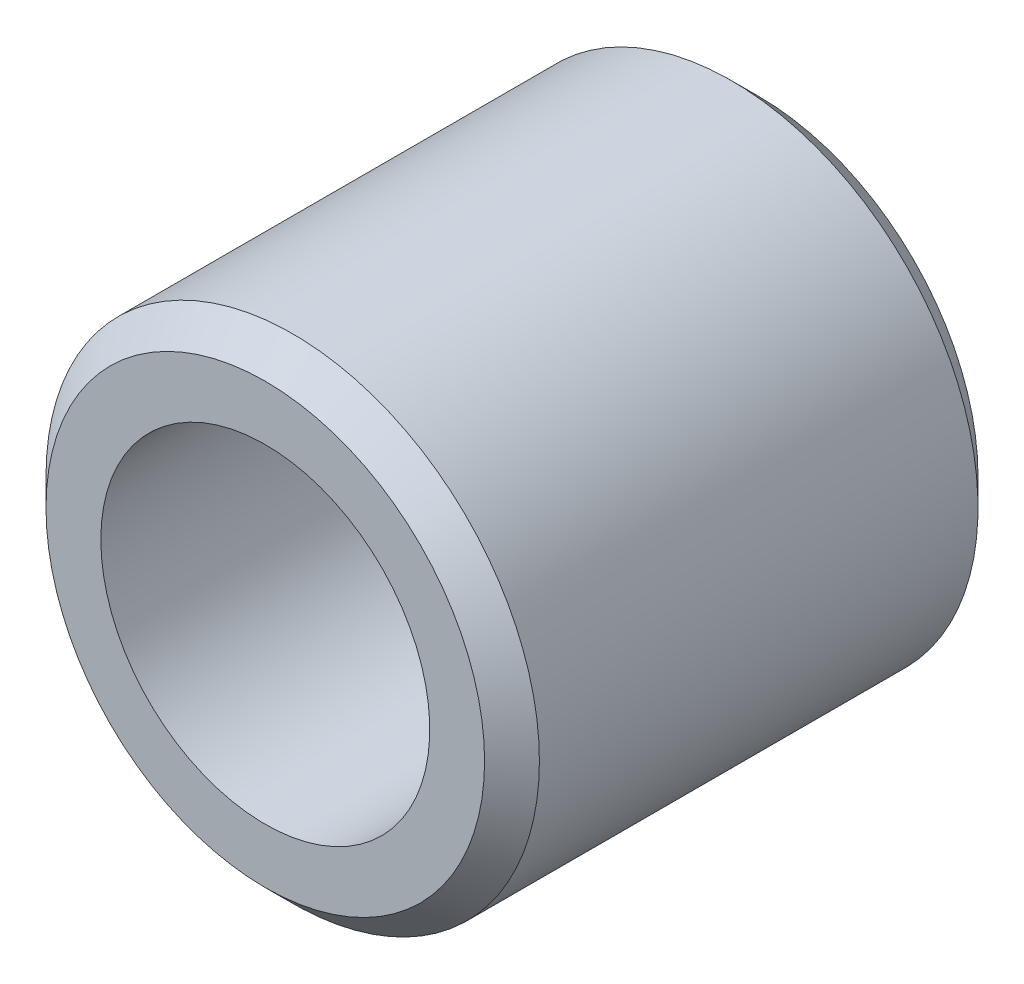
ISO-10303-21;
HEADER;
FILE_DESCRIPTION(('STEP AP214'),'2;1');
FILE_NAME('part.step','',(''),(''),'','','');
FILE_SCHEMA(('AUTOMOTIVE_DESIGN { 1 0 10303 214 1 1 1 1 }'));
ENDSEC;
DATA;
#1=APPLICATION_CONTEXT('core data for automotive mechanical design processes');
#2=APPLICATION_PROTOCOL_DEFINITION('international standard','automotive_design',2000,#1);
#3=PRODUCT_CONTEXT('',#1,'mechanical');
#4=PRODUCT('Part','Part','',(#3));
#5=PRODUCT_RELATED_PRODUCT_CATEGORY('part','',(#4));
#6=PRODUCT_DEFINITION_FORMATION('','',#4);
#7=PRODUCT_DEFINITION_CONTEXT('part definition',#1,'design');
#8=PRODUCT_DEFINITION('design','',#6,#7);
#9=PRODUCT_DEFINITION_SHAPE('','',#8);
#10=(LENGTH_UNIT() NAMED_UNIT(*) SI_UNIT(.MILLI.,.METRE.));
#11=(NAMED_UNIT(*) PLANE_ANGLE_UNIT() SI_UNIT($,.RADIAN.));
#12=(NAMED_UNIT(*) SI_UNIT($,.STERADIAN.) SOLID_ANGLE_UNIT());
#13=UNCERTAINTY_MEASURE_WITH_UNIT(LENGTH_MEASURE(1.E-05),#10,'distance_accuracy_value','');
#14=(GEOMETRIC_REPRESENTATION_CONTEXT(3) GLOBAL_UNCERTAINTY_ASSIGNED_CONTEXT((#13)) GLOBAL_UNIT_ASSIGNED_CONTEXT((#10,
#11,#12)) REPRESENTATION_CONTEXT('',''));
#15=CARTESIAN_POINT('',(0.,0.,0.));
#16=DIRECTION('',(0.,0.,1.));
#17=DIRECTION('',(1.,0.,0.));
#18=AXIS2_PLACEMENT_3D('',#15,#16,#17);
#19=CARTESIAN_POINT('',(0.,0.,0.));
#20=DIRECTION('',(0.,0.,-1.));
#21=DIRECTION('',(-1.,0.,0.));
#22=AXIS2_PLACEMENT_3D('',#19,#20,#21);
#23=CYLINDRICAL_SURFACE('',#22,6.);
#24=CARTESIAN_POINT('',(0.,0.,0.));
#25=DIRECTION('',(0.,0.,-1.));
#26=DIRECTION('',(-1.,0.,0.));
#27=AXIS2_PLACEMENT_3D('',#24,#25,#26);
#28=CIRCLE('',#27,6.);
#29=CARTESIAN_POINT('',(-6.,0.,0.));
#30=VERTEX_POINT('',#29);
#31=EDGE_CURVE('E34',#30,#30,#28,.T.);
#32=ORIENTED_EDGE('',*,*,#31,.T.);
#33=EDGE_LOOP('',(#32));
#34=FACE_BOUND('',#33,.T.);
#35=CARTESIAN_POINT('',(0.,0.,18.));
#36=DIRECTION('',(0.,0.,-1.));
#37=DIRECTION('',(-1.,0.,0.));
#38=AXIS2_PLACEMENT_3D('',#35,#36,#37);
#39=CIRCLE('',#38,6.);
#40=CARTESIAN_POINT('',(-6.,0.,18.));
#41=VERTEX_POINT('',#40);
#42=EDGE_CURVE('E31',#41,#41,#39,.T.);
#43=ORIENTED_EDGE('',*,*,#42,.F.);
#44=EDGE_LOOP('',(#43));
#45=FACE_BOUND('',#44,.T.);
#46=ADVANCED_FACE('F12',(#34,#45),#23,.F.);
#47=CARTESIAN_POINT('',(-6.,0.,18.));
#48=DIRECTION('',(0.,0.,1.));
#49=DIRECTION('',(1.,0.,0.));
#50=AXIS2_PLACEMENT_3D('',#47,#48,#49);
#51=PLANE('',#50);
#52=CARTESIAN_POINT('',(0.,0.,18.));
#53=DIRECTION('',(0.,0.,1.));
#54=DIRECTION('',(1.,0.,0.));
#55=AXIS2_PLACEMENT_3D('',#52,#53,#54);
#56=CIRCLE('',#55,8.);
#57=CARTESIAN_POINT('',(8.,0.,18.));
#58=VERTEX_POINT('',#57);
#59=EDGE_CURVE('E8',#58,#58,#56,.T.);
#60=ORIENTED_EDGE('',*,*,#59,.T.);
#61=EDGE_LOOP('',(#60));
#62=FACE_BOUND('',#61,.T.);
#63=ORIENTED_EDGE('',*,*,#42,.T.);
#64=EDGE_LOOP('',(#63));
#65=FACE_BOUND('',#64,.T.);
#66=ADVANCED_FACE('F55',(#62,#65),#51,.T.);
#67=CARTESIAN_POINT('',(0.,0.,0.));
#68=DIRECTION('',(0.,0.,-1.));
#69=DIRECTION('',(-1.,0.,0.));
#70=AXIS2_PLACEMENT_3D('',#67,#68,#69);
#71=CYLINDRICAL_SURFACE('',#70,9.);
#72=CARTESIAN_POINT('',(0.,0.,0.999999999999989));
#73=DIRECTION('',(0.,0.,-1.));
#74=DIRECTION('',(-1.,0.,0.));
#75=AXIS2_PLACEMENT_3D('',#72,#73,#74);
#76=CIRCLE('',#75,9.);
#77=CARTESIAN_POINT('',(-9.,0.,0.999999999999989));
#78=VERTEX_POINT('',#77);
#79=EDGE_CURVE('E18',#78,#78,#76,.F.);
#80=ORIENTED_EDGE('',*,*,#79,.T.);
#81=EDGE_LOOP('',(#80));
#82=FACE_BOUND('',#81,.T.);
#83=CARTESIAN_POINT('',(0.,0.,17.));
#84=DIRECTION('',(0.,0.,1.));
#85=DIRECTION('',(1.,0.,0.));
#86=AXIS2_PLACEMENT_3D('',#83,#84,#85);
#87=CIRCLE('',#86,9.);
#88=CARTESIAN_POINT('',(9.,0.,17.));
#89=VERTEX_POINT('',#88);
#90=EDGE_CURVE('E22',#89,#89,#87,.F.);
#91=ORIENTED_EDGE('',*,*,#90,.T.);
#92=EDGE_LOOP('',(#91));
#93=FACE_BOUND('',#92,.T.);
#94=ADVANCED_FACE('F43',(#82,#93),#71,.T.);
#95=CARTESIAN_POINT('',(-6.,0.,0.));
#96=DIRECTION('',(0.,0.,-1.));
#97=DIRECTION('',(-1.,0.,0.));
#98=AXIS2_PLACEMENT_3D('',#95,#96,#97);
#99=PLANE('',#98);
#100=CARTESIAN_POINT('',(0.,0.,0.));
#101=DIRECTION('',(0.,0.,-1.));
#102=DIRECTION('',(-1.,0.,0.));
#103=AXIS2_PLACEMENT_3D('',#100,#101,#102);
#104=CIRCLE('',#103,8.);
#105=CARTESIAN_POINT('',(-8.,0.,0.));
#106=VERTEX_POINT('',#105);
#107=EDGE_CURVE('E26',#106,#106,#104,.T.);
#108=ORIENTED_EDGE('',*,*,#107,.T.);
#109=EDGE_LOOP('',(#108));
#110=FACE_BOUND('',#109,.T.);
#111=ORIENTED_EDGE('',*,*,#31,.F.);
#112=EDGE_LOOP('',(#111));
#113=FACE_BOUND('',#112,.T.);
#114=ADVANCED_FACE('F40',(#110,#113),#99,.T.);
#115=CARTESIAN_POINT('',(0.,0.,0.));
#116=DIRECTION('',(0.,0.,1.));
#117=DIRECTION('',(1.,0.,0.));
#118=AXIS2_PLACEMENT_3D('',#115,#116,#117);
#119=CONICAL_SURFACE('',#118,8.,0.785398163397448);
#120=ORIENTED_EDGE('',*,*,#79,.F.);
#121=EDGE_LOOP('',(#120));
#122=FACE_BOUND('',#121,.T.);
#123=ORIENTED_EDGE('',*,*,#107,.F.);
#124=EDGE_LOOP('',(#123));
#125=FACE_BOUND('',#124,.T.);
#126=ADVANCED_FACE('F42',(#122,#125),#119,.T.);
#127=CARTESIAN_POINT('',(0.,0.,17.));
#128=DIRECTION('',(0.,0.,-1.));
#129=DIRECTION('',(-1.,0.,0.));
#130=AXIS2_PLACEMENT_3D('',#127,#128,#129);
#131=CONICAL_SURFACE('',#130,9.,0.785398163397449);
#132=ORIENTED_EDGE('',*,*,#59,.F.);
#133=EDGE_LOOP('',(#132));
#134=FACE_BOUND('',#133,.T.);
#135=ORIENTED_EDGE('',*,*,#90,.F.);
#136=EDGE_LOOP('',(#135));
#137=FACE_BOUND('',#136,.T.);
#138=ADVANCED_FACE('F52',(#134,#137),#131,.T.);
#139=CLOSED_SHELL('',(#46,#66,#94,#114,#126,#138));
#140=MANIFOLD_SOLID_BREP('B1',#139);
#141=ADVANCED_BREP_SHAPE_REPRESENTATION('',(#18,#140),#14);
#142=SHAPE_DEFINITION_REPRESENTATION(#9,#141);
ENDSEC;
END-ISO-10303-21;
